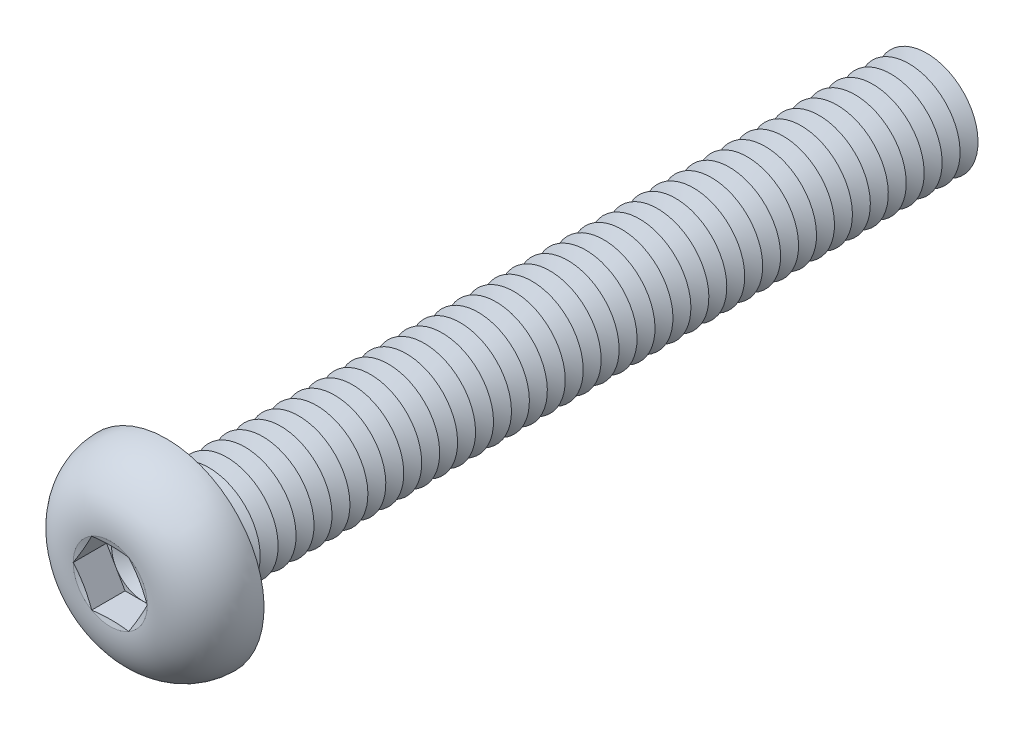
from build123d import *

# Parameters (mm, degrees)
FILLET1_R          = 0.35
LPATTERN1_COUNT    = 42
LPATTERN1_PITCH    = 0.7
CUT_EXTRUDE1_DEPTH = 1.3


with BuildPart() as part:
    # Sketch1 → Revolve1 (revolve)
    with BuildSketch(Plane(origin=(0, 0, 0), x_dir=(0, 0, -1), z_dir=(1, 0, 0))):
        with BuildLine():
            Line((0, 2), (0, 3.8))
            ThreePointArc((0, 3.8), (-1.611961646, 3.099623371), (-2.2, 1.443375))
            Line((-2.2, 1.443375), (-2.006624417, 0.7216875))
            Line((-2.006624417, 0.7216875), (-2.2, 0.7216875))
            Line((-2.2, 0.7216875), (-2.2, 0))
            Line((-2.2, 0), (30, 0))
            Line((30, 0), (30, 2))
            Line((30, 2), (0, 2))
        make_face()
    revolve(axis=Axis((0, 0, -30), (0, 0, 1)))

    # Fillet1
    fillet1_edges = [part.edges().sort_by_distance(p)[0] for p in [
        (0, -2, 0),
    ]]
    fillet(fillet1_edges, radius=FILLET1_R)

    # Sketch2 → Cut-Revolve1 (revolve, cut)
    with BuildSketch(Plane(origin=(0, 0, 0), x_dir=(0, 0, -1), z_dir=(1, 0, 0))):
        Polygon((29.65, 2), (30.35, 2), (30, 1.393782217), align=None)
    cut_revolve1 = revolve(axis=Axis((0, 0, -30), (0, 0, -1)), mode=Mode.SUBTRACT)

    # LPattern1: Cut-Revolve1 ×42
    with Locations(*[(0, 0, i * LPATTERN1_PITCH) for i in range(1, LPATTERN1_COUNT)]):
        add(cut_revolve1, mode=Mode.SUBTRACT)

    # Sketch3 → Cut-Extrude1 (cut)
    with BuildSketch(Plane.XY.offset(2.2)):
        Polygon((0.7216875, 1.249999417), (-0.7216875, 1.249999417), (-1.443375, 0), (-0.7216875, -1.249999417), (0.7216875, -1.249999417), (1.443375, 0), align=None)
    extrude(amount=-CUT_EXTRUDE1_DEPTH, mode=Mode.SUBTRACT)

    # Cut-Extrude2 cone 1 section (on through the dimple's axis) → Cut-Extrude2 (revolve, cut)
    with BuildSketch(Plane(origin=(0, 0, 0.9), x_dir=(0, -1, 0), z_dir=(1, 0, 0))):
        Polygon((0, 0), (1.249999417, 0), (0, 0.7216875), align=None)
    revolve(axis=Axis((0, 0, 0.9), (0, 0, -1)), mode=Mode.SUBTRACT)


solid = part.part
